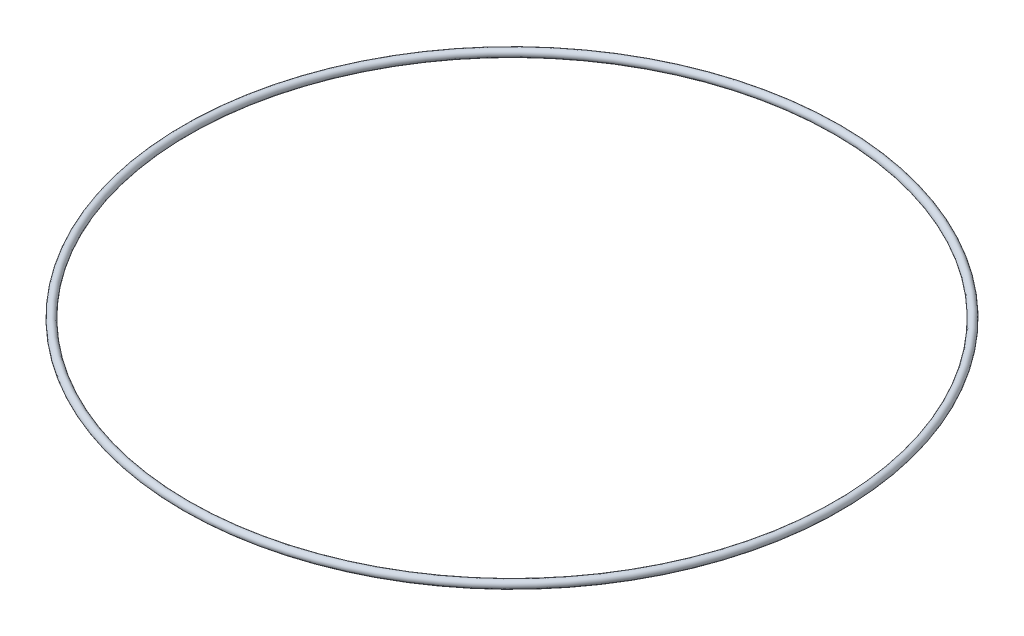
ISO-10303-21;
HEADER;
FILE_DESCRIPTION(('STEP AP214'),'2;1');
FILE_NAME('part.step','',(''),(''),'','','');
FILE_SCHEMA(('AUTOMOTIVE_DESIGN { 1 0 10303 214 1 1 1 1 }'));
ENDSEC;
DATA;
#1=APPLICATION_CONTEXT('core data for automotive mechanical design processes');
#2=APPLICATION_PROTOCOL_DEFINITION('international standard','automotive_design',2000,#1);
#3=PRODUCT_CONTEXT('',#1,'mechanical');
#4=PRODUCT('Part','Part','',(#3));
#5=PRODUCT_RELATED_PRODUCT_CATEGORY('part','',(#4));
#6=PRODUCT_DEFINITION_FORMATION('','',#4);
#7=PRODUCT_DEFINITION_CONTEXT('part definition',#1,'design');
#8=PRODUCT_DEFINITION('design','',#6,#7);
#9=PRODUCT_DEFINITION_SHAPE('','',#8);
#10=(LENGTH_UNIT() NAMED_UNIT(*) SI_UNIT(.MILLI.,.METRE.));
#11=(NAMED_UNIT(*) PLANE_ANGLE_UNIT() SI_UNIT($,.RADIAN.));
#12=(NAMED_UNIT(*) SI_UNIT($,.STERADIAN.) SOLID_ANGLE_UNIT());
#13=UNCERTAINTY_MEASURE_WITH_UNIT(LENGTH_MEASURE(1.E-05),#10,'distance_accuracy_value','');
#14=(GEOMETRIC_REPRESENTATION_CONTEXT(3) GLOBAL_UNCERTAINTY_ASSIGNED_CONTEXT((#13)) GLOBAL_UNIT_ASSIGNED_CONTEXT((#10,
#11,#12)) REPRESENTATION_CONTEXT('',''));
#15=CARTESIAN_POINT('',(0.,0.,0.));
#16=DIRECTION('',(0.,0.,1.));
#17=DIRECTION('',(1.,0.,0.));
#18=AXIS2_PLACEMENT_3D('',#15,#16,#17);
#19=CARTESIAN_POINT('',(0.,0.,0.));
#20=DIRECTION('',(0.,1.,0.));
#21=DIRECTION('',(0.,0.,1.));
#22=AXIS2_PLACEMENT_3D('',#19,#20,#21);
#23=TOROIDAL_SURFACE('',#22,127.,1.5);
#24=CARTESIAN_POINT('',(0.,0.,128.5));
#25=VERTEX_POINT('',#24);
#26=VERTEX_LOOP('',#25);
#27=FACE_BOUND('',#26,.T.);
#28=ADVANCED_FACE('F26',(#27),#23,.T.);
#29=CLOSED_SHELL('',(#28));
#30=MANIFOLD_SOLID_BREP('B2',#29);
#31=ADVANCED_BREP_SHAPE_REPRESENTATION('',(#18,#30),#14);
#32=SHAPE_DEFINITION_REPRESENTATION(#9,#31);
ENDSEC;
END-ISO-10303-21;
